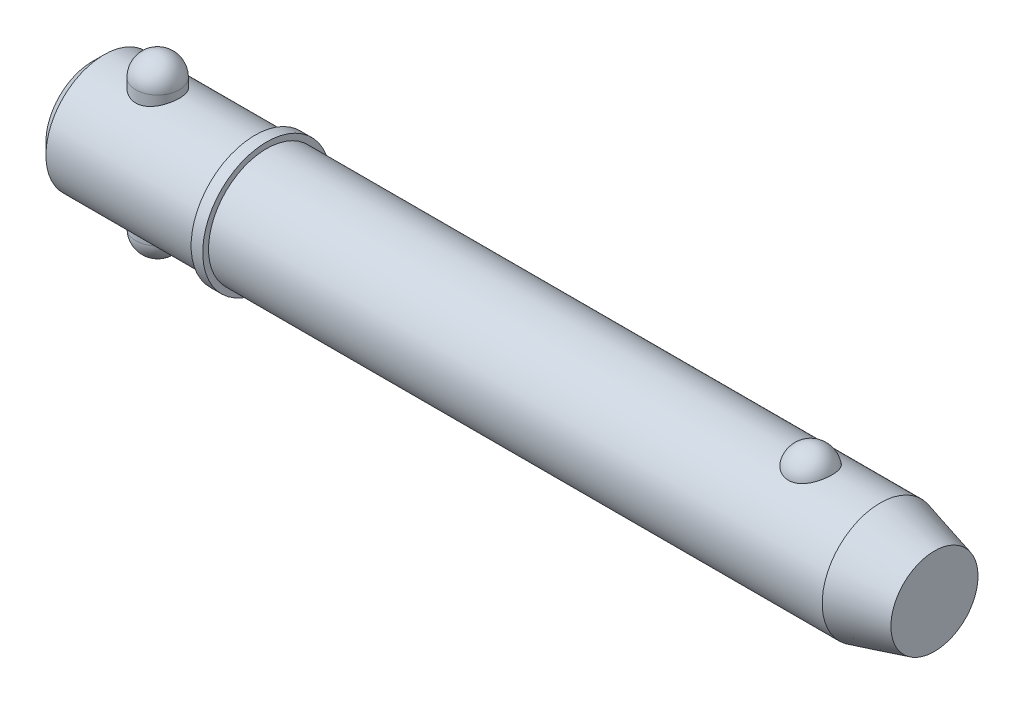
ISO-10303-21;
HEADER;
FILE_DESCRIPTION(('STEP AP214'),'2;1');
FILE_NAME('part.step','',(''),(''),'','','');
FILE_SCHEMA(('AUTOMOTIVE_DESIGN { 1 0 10303 214 1 1 1 1 }'));
ENDSEC;
DATA;
#1=APPLICATION_CONTEXT('core data for automotive mechanical design processes');
#2=APPLICATION_PROTOCOL_DEFINITION('international standard','automotive_design',2000,#1);
#3=PRODUCT_CONTEXT('',#1,'mechanical');
#4=PRODUCT('Part','Part','',(#3));
#5=PRODUCT_RELATED_PRODUCT_CATEGORY('part','',(#4));
#6=PRODUCT_DEFINITION_FORMATION('','',#4);
#7=PRODUCT_DEFINITION_CONTEXT('part definition',#1,'design');
#8=PRODUCT_DEFINITION('design','',#6,#7);
#9=PRODUCT_DEFINITION_SHAPE('','',#8);
#10=(LENGTH_UNIT() NAMED_UNIT(*) SI_UNIT(.MILLI.,.METRE.));
#11=(NAMED_UNIT(*) PLANE_ANGLE_UNIT() SI_UNIT($,.RADIAN.));
#12=(NAMED_UNIT(*) SI_UNIT($,.STERADIAN.) SOLID_ANGLE_UNIT());
#13=UNCERTAINTY_MEASURE_WITH_UNIT(LENGTH_MEASURE(1.E-05),#10,'distance_accuracy_value','');
#14=(GEOMETRIC_REPRESENTATION_CONTEXT(3) GLOBAL_UNCERTAINTY_ASSIGNED_CONTEXT((#13)) GLOBAL_UNIT_ASSIGNED_CONTEXT((#10,
#11,#12)) REPRESENTATION_CONTEXT('',''));
#15=CARTESIAN_POINT('',(0.,0.,0.));
#16=DIRECTION('',(0.,0.,1.));
#17=DIRECTION('',(1.,0.,0.));
#18=AXIS2_PLACEMENT_3D('',#15,#16,#17);
#19=CARTESIAN_POINT('',(14.28,19.05,0.));
#20=DIRECTION('',(0.,-1.,0.));
#21=DIRECTION('',(0.,0.,-1.));
#22=AXIS2_PLACEMENT_3D('',#19,#20,#21);
#23=CYLINDRICAL_SURFACE('',#22,4.76);
#24=CARTESIAN_POINT('',(14.28,-14.29,0.));
#25=DIRECTION('',(0.,-1.,0.));
#26=DIRECTION('',(0.,0.,-1.));
#27=AXIS2_PLACEMENT_3D('',#24,#25,#26);
#28=CIRCLE('',#27,4.76);
#29=CARTESIAN_POINT('',(14.28,-14.29,-4.76));
#30=VERTEX_POINT('',#29);
#31=EDGE_CURVE('P0_E10',#30,#30,#28,.F.);
#32=CARTESIAN_POINT('',(14.28,14.29,0.));
#33=DIRECTION('',(0.,-1.,0.));
#34=DIRECTION('',(0.,0.,-1.));
#35=AXIS2_PLACEMENT_3D('',#32,#33,#34);
#36=CIRCLE('',#35,4.76);
#37=CARTESIAN_POINT('',(14.28,14.29,-4.76));
#38=VERTEX_POINT('',#37);
#39=EDGE_CURVE('P0_E21',#38,#38,#36,.T.);
#40=CARTESIAN_POINT('',(14.28,-14.29,-4.76));
#41=CARTESIAN_POINT('',(14.28,-13.9922916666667,-4.76));
#42=CARTESIAN_POINT('',(14.28,-13.6945833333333,-4.76));
#43=CARTESIAN_POINT('',(14.28,-13.0991666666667,-4.76));
#44=CARTESIAN_POINT('',(14.28,-12.8014583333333,-4.76));
#45=CARTESIAN_POINT('',(14.28,-12.2060416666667,-4.76));
#46=CARTESIAN_POINT('',(14.28,-11.9083333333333,-4.76));
#47=CARTESIAN_POINT('',(14.28,-11.3129166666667,-4.76));
#48=CARTESIAN_POINT('',(14.28,-11.0152083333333,-4.76));
#49=CARTESIAN_POINT('',(14.28,-10.4197916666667,-4.76));
#50=CARTESIAN_POINT('',(14.28,-10.1220833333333,-4.76));
#51=CARTESIAN_POINT('',(14.28,-9.52666666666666,-4.76));
#52=CARTESIAN_POINT('',(14.28,-9.22895833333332,-4.76));
#53=CARTESIAN_POINT('',(14.28,-8.63354166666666,-4.76));
#54=CARTESIAN_POINT('',(14.28,-8.33583333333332,-4.76));
#55=CARTESIAN_POINT('',(14.28,-7.74041666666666,-4.76));
#56=CARTESIAN_POINT('',(14.28,-7.44270833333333,-4.76));
#57=CARTESIAN_POINT('',(14.28,-6.84729166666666,-4.76));
#58=CARTESIAN_POINT('',(14.28,-6.54958333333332,-4.76));
#59=CARTESIAN_POINT('',(14.28,-5.95416666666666,-4.76));
#60=CARTESIAN_POINT('',(14.28,-5.65645833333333,-4.76));
#61=CARTESIAN_POINT('',(14.28,-5.06104166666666,-4.76));
#62=CARTESIAN_POINT('',(14.28,-4.76333333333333,-4.76));
#63=CARTESIAN_POINT('',(14.28,-4.16791666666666,-4.76));
#64=CARTESIAN_POINT('',(14.28,-3.87020833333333,-4.76));
#65=CARTESIAN_POINT('',(14.28,-3.27479166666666,-4.76));
#66=CARTESIAN_POINT('',(14.28,-2.97708333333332,-4.76));
#67=CARTESIAN_POINT('',(14.28,-2.38166666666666,-4.76));
#68=CARTESIAN_POINT('',(14.28,-2.08395833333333,-4.76));
#69=CARTESIAN_POINT('',(14.28,-1.48854166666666,-4.76));
#70=CARTESIAN_POINT('',(14.28,-1.19083333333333,-4.76));
#71=CARTESIAN_POINT('',(14.28,-0.595416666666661,-4.76));
#72=CARTESIAN_POINT('',(14.28,-0.297708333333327,-4.76));
#73=CARTESIAN_POINT('',(14.28,0.297708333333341,-4.76));
#74=CARTESIAN_POINT('',(14.28,0.595416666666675,-4.76));
#75=CARTESIAN_POINT('',(14.28,1.19083333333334,-4.76));
#76=CARTESIAN_POINT('',(14.28,1.48854166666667,-4.76));
#77=CARTESIAN_POINT('',(14.28,2.08395833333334,-4.76));
#78=CARTESIAN_POINT('',(14.28,2.38166666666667,-4.76));
#79=CARTESIAN_POINT('',(14.28,2.97708333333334,-4.76));
#80=CARTESIAN_POINT('',(14.28,3.27479166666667,-4.76));
#81=CARTESIAN_POINT('',(14.28,3.87020833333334,-4.76));
#82=CARTESIAN_POINT('',(14.28,4.16791666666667,-4.76));
#83=CARTESIAN_POINT('',(14.28,4.76333333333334,-4.76));
#84=CARTESIAN_POINT('',(14.28,5.06104166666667,-4.76));
#85=CARTESIAN_POINT('',(14.28,5.65645833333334,-4.76));
#86=CARTESIAN_POINT('',(14.28,5.95416666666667,-4.76));
#87=CARTESIAN_POINT('',(14.28,6.54958333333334,-4.76));
#88=CARTESIAN_POINT('',(14.28,6.84729166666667,-4.76));
#89=CARTESIAN_POINT('',(14.28,7.44270833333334,-4.76));
#90=CARTESIAN_POINT('',(14.28,7.74041666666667,-4.76));
#91=CARTESIAN_POINT('',(14.28,8.33583333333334,-4.76));
#92=CARTESIAN_POINT('',(14.28,8.63354166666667,-4.76));
#93=CARTESIAN_POINT('',(14.28,9.22895833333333,-4.76));
#94=CARTESIAN_POINT('',(14.28,9.52666666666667,-4.76));
#95=CARTESIAN_POINT('',(14.28,10.1220833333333,-4.76));
#96=CARTESIAN_POINT('',(14.28,10.4197916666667,-4.76));
#97=CARTESIAN_POINT('',(14.28,11.0152083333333,-4.76));
#98=CARTESIAN_POINT('',(14.28,11.3129166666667,-4.76));
#99=CARTESIAN_POINT('',(14.28,11.9083333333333,-4.76));
#100=CARTESIAN_POINT('',(14.28,12.2060416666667,-4.76));
#101=CARTESIAN_POINT('',(14.28,12.8014583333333,-4.76));
#102=CARTESIAN_POINT('',(14.28,13.0991666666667,-4.76));
#103=CARTESIAN_POINT('',(14.28,13.6945833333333,-4.76));
#104=CARTESIAN_POINT('',(14.28,13.9922916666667,-4.76));
#105=CARTESIAN_POINT('',(14.28,14.29,-4.76));
#106=B_SPLINE_CURVE_WITH_KNOTS('',3,(#40,#41,#42,#43,#44,#45,#46,#47,#48,#49,#50,#51,#52,#53,
#54,#55,#56,#57,#58,#59,#60,#61,#62,#63,#64,#65,#66,#67,#68,#69,#70,#71,#72,#73,#74,#75,#76,#77,
#78,#79,#80,#81,#82,#83,#84,#85,#86,#87,#88,#89,#90,#91,#92,#93,#94,#95,#96,#97,#98,#99,#100,
#101,#102,#103,#104,#105),.UNSPECIFIED.,.F.,.F.,(4,2,2,2,2,2,2,2,2,2,2,2,2,2,2,2,2,2,2,2,2,2,2,
2,2,2,2,2,2,2,2,2,4),(0.,0.893125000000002,1.78625,2.67937499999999,3.5725,4.465625,5.35875,
6.25187499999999,7.145,8.038125,8.93125,9.82437499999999,10.7175,11.610625,12.50375,13.396875,
14.29,15.183125,16.07625,16.969375,17.8625,18.755625,19.64875,20.541875,21.435,22.328125,
23.22125,24.114375,25.0075,25.900625,26.79375,27.686875,28.58),.UNSPECIFIED.);
#107=EDGE_CURVE('P0_BSEAM14',#30,#38,#106,.T.);
#108=ORIENTED_EDGE('',*,*,#31,.T.);
#109=ORIENTED_EDGE('',*,*,#39,.T.);
#110=ORIENTED_EDGE('',*,*,#107,.T.);
#111=ORIENTED_EDGE('',*,*,#107,.F.);
#112=EDGE_LOOP('',(#108,#110,#109,#111));
#113=FACE_BOUND('',#112,.T.);
#114=ADVANCED_FACE('P0_F14',(#113),#23,.T.);
#115=CARTESIAN_POINT('',(14.28,-14.29,0.));
#116=DIRECTION('',(0.,0.,1.));
#117=DIRECTION('',(1.,0.,0.));
#118=AXIS2_PLACEMENT_3D('',#115,#116,#117);
#119=SPHERICAL_SURFACE('',#118,4.76);
#120=CARTESIAN_POINT('',(14.28,-14.29,0.));
#121=DIRECTION('',(0.,-1.,0.));
#122=DIRECTION('',(0.,0.,-1.));
#123=AXIS2_PLACEMENT_3D('',#120,#121,#122);
#124=SPHERICAL_SURFACE('',#123,4.76);
#125=ORIENTED_EDGE('',*,*,#31,.F.);
#126=EDGE_LOOP('',(#125));
#127=FACE_BOUND('',#126,.T.);
#128=ADVANCED_FACE('P0_F29',(#127),#124,.T.);
#129=CARTESIAN_POINT('',(14.28,14.29,0.));
#130=DIRECTION('',(0.,0.,1.));
#131=DIRECTION('',(1.,0.,0.));
#132=AXIS2_PLACEMENT_3D('',#129,#130,#131);
#133=SPHERICAL_SURFACE('',#132,4.76);
#134=CARTESIAN_POINT('',(14.28,14.29,0.));
#135=DIRECTION('',(0.,-1.,0.));
#136=DIRECTION('',(0.,0.,-1.));
#137=AXIS2_PLACEMENT_3D('',#134,#135,#136);
#138=SPHERICAL_SURFACE('',#137,4.76);
#139=ORIENTED_EDGE('',*,*,#39,.F.);
#140=EDGE_LOOP('',(#139));
#141=FACE_BOUND('',#140,.T.);
#142=ADVANCED_FACE('P0_F16',(#141),#138,.T.);
#143=CLOSED_SHELL('',(#114,#128,#142));
#144=MANIFOLD_SOLID_BREP('P0_B1',#143);
#145=CARTESIAN_POINT('',(0.,0.,0.));
#146=DIRECTION('',(1.,0.,0.));
#147=DIRECTION('',(0.,0.,-1.));
#148=AXIS2_PLACEMENT_3D('',#145,#146,#147);
#149=CYLINDRICAL_SURFACE('',#148,12.7);
#150=CARTESIAN_POINT('',(172.300738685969,0.,0.));
#151=DIRECTION('',(1.,0.,0.));
#152=DIRECTION('',(0.,0.,-1.));
#153=AXIS2_PLACEMENT_3D('',#150,#151,#152);
#154=CIRCLE('',#153,12.7);
#155=CARTESIAN_POINT('',(172.300738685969,0.,-12.7));
#156=VERTEX_POINT('',#155);
#157=EDGE_CURVE('P1_E81',#156,#156,#154,.T.);
#158=ORIENTED_EDGE('',*,*,#157,.F.);
#159=EDGE_LOOP('',(#158));
#160=FACE_BOUND('',#159,.T.);
#161=CARTESIAN_POINT('',(38.1,0.,0.));
#162=DIRECTION('',(1.,0.,0.));
#163=DIRECTION('',(0.,0.,-1.));
#164=AXIS2_PLACEMENT_3D('',#161,#162,#163);
#165=CIRCLE('',#164,12.7);
#166=CARTESIAN_POINT('',(38.1,0.,-12.7));
#167=VERTEX_POINT('',#166);
#168=EDGE_CURVE('P1_E85',#167,#167,#165,.T.);
#169=ORIENTED_EDGE('',*,*,#168,.T.);
#170=EDGE_LOOP('',(#169));
#171=FACE_BOUND('',#170,.T.);
#172=CARTESIAN_POINT('',(157.060042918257,11.7500437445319,4.81938502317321));
#173=CARTESIAN_POINT('',(156.935088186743,11.7500430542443,4.81938571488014));
#174=CARTESIAN_POINT('',(156.810144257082,11.7520975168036,4.81438658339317));
#175=CARTESIAN_POINT('',(156.561142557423,11.760253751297,4.7944290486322));
#176=CARTESIAN_POINT('',(156.437085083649,11.7663568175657,4.77946746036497));
#177=CARTESIAN_POINT('',(156.190901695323,11.7824262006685,4.73971414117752));
#178=CARTESIAN_POINT('',(156.068774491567,11.7923898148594,4.71492928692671));
#179=CARTESIAN_POINT('',(155.827187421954,11.8158938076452,4.65571340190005));
#180=CARTESIAN_POINT('',(155.70772859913,11.8294355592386,4.62127866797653));
#181=CARTESIAN_POINT('',(155.472557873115,11.8596812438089,4.5430950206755));
#182=CARTESIAN_POINT('',(155.356839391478,11.8763792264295,4.49936361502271));
#183=CARTESIAN_POINT('',(155.129653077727,11.9124878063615,4.40287235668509));
#184=CARTESIAN_POINT('',(155.018186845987,11.9318994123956,4.35010914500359));
#185=CARTESIAN_POINT('',(154.691278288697,11.9934256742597,4.17881316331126));
#186=CARTESIAN_POINT('',(154.483127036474,12.038858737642,4.04720756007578));
#187=CARTESIAN_POINT('',(154.085850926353,12.1352173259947,3.74856446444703));
#188=CARTESIAN_POINT('',(153.897443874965,12.1862630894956,3.58061821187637));
#189=CARTESIAN_POINT('',(153.550521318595,12.2875163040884,3.21600758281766));
#190=CARTESIAN_POINT('',(153.392011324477,12.3377235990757,3.01933792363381));
#191=CARTESIAN_POINT('',(153.10168878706,12.434492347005,2.59291655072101));
#192=CARTESIAN_POINT('',(152.971376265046,12.4807925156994,2.36208286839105));
#193=CARTESIAN_POINT('',(152.749407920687,12.5623454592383,1.88070399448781));
#194=CARTESIAN_POINT('',(152.657755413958,12.5975972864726,1.63015711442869));
#195=CARTESIAN_POINT('',(152.514046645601,12.6538414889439,1.11298869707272));
#196=CARTESIAN_POINT('',(152.462499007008,12.6746503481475,0.846205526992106));
#197=CARTESIAN_POINT('',(152.401977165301,12.699153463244,0.307085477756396));
#198=CARTESIAN_POINT('',(152.393001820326,12.7028481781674,0.0347487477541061));
#199=CARTESIAN_POINT('',(152.417731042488,12.6927785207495,-0.506073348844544));
#200=CARTESIAN_POINT('',(152.451189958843,12.6791146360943,-0.774571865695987));
#201=CARTESIAN_POINT('',(152.559687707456,12.635882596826,-1.30170246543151));
#202=CARTESIAN_POINT('',(152.63472729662,12.606314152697,-1.5603343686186));
#203=CARTESIAN_POINT('',(152.82500006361,12.5342328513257,-2.06083899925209));
#204=CARTESIAN_POINT('',(152.940287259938,12.4917026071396,-2.30268867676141));
#205=CARTESIAN_POINT('',(153.208704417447,12.3981123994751,-2.76259600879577));
#206=CARTESIAN_POINT('',(153.361837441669,12.3470517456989,-2.98065173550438));
#207=CARTESIAN_POINT('',(153.703507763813,12.2416045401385,-3.38786328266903));
#208=CARTESIAN_POINT('',(153.892201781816,12.1872040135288,-3.57688418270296));
#209=CARTESIAN_POINT('',(154.300239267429,12.0814086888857,-3.91941073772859));
#210=CARTESIAN_POINT('',(154.519580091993,12.0300136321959,-4.07291945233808));
#211=CARTESIAN_POINT('',(154.978375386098,11.9373542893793,-4.3369128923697));
#212=CARTESIAN_POINT('',(155.217304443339,11.8958982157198,-4.4482412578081));
#213=CARTESIAN_POINT('',(155.71243761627,11.8268116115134,-4.62881985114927));
#214=CARTESIAN_POINT('',(155.968635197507,11.7991758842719,-4.69808589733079));
#215=CARTESIAN_POINT('',(156.477164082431,11.7622209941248,-4.7898318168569));
#216=CARTESIAN_POINT('',(156.729041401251,11.7520502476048,-4.81449025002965));
#217=CARTESIAN_POINT('',(157.233573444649,11.7485796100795,-4.82295735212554));
#218=CARTESIAN_POINT('',(157.486228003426,11.7552763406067,-4.80677420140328));
#219=CARTESIAN_POINT('',(157.976834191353,11.7842584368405,-4.73525430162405));
#220=CARTESIAN_POINT('',(158.214998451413,11.8060486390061,-4.68116061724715));
#221=CARTESIAN_POINT('',(158.678489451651,11.8622750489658,-4.53678133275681));
#222=CARTESIAN_POINT('',(158.903815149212,11.8967122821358,-4.44649279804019));
#223=CARTESIAN_POINT('',(159.340801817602,11.9754603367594,-4.22987613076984));
#224=CARTESIAN_POINT('',(159.552057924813,12.0199699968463,-4.1028053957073));
#225=CARTESIAN_POINT('',(159.950601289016,12.1138028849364,-3.81685409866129));
#226=CARTESIAN_POINT('',(160.137883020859,12.163127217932,-3.65796622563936));
#227=CARTESIAN_POINT('',(160.493350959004,12.2642343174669,-3.30364864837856));
#228=CARTESIAN_POINT('',(160.660111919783,12.3160165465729,-3.10678783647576));
#229=CARTESIAN_POINT('',(160.959579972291,12.4142566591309,-2.68748409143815));
#230=CARTESIAN_POINT('',(161.092280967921,12.4607135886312,-2.46503658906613));
#231=CARTESIAN_POINT('',(161.324691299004,12.5450236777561,-1.99289519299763));
#232=CARTESIAN_POINT('',(161.423215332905,12.5825557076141,-1.74255918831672));
#233=CARTESIAN_POINT('',(161.579227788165,12.6431720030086,-1.22773734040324));
#234=CARTESIAN_POINT('',(161.636715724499,12.6662560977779,-0.963251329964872));
#235=CARTESIAN_POINT('',(161.709544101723,12.6956486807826,-0.42735507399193));
#236=CARTESIAN_POINT('',(161.724837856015,12.7019385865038,-0.155937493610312));
#237=CARTESIAN_POINT('',(161.712779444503,12.6970201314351,0.385928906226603));
#238=CARTESIAN_POINT('',(161.68542805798,12.6858120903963,0.656377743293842));
#239=CARTESIAN_POINT('',(161.613060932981,12.6568455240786,1.0545401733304));
#240=CARTESIAN_POINT('',(161.583796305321,12.6451962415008,1.18577850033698));
#241=CARTESIAN_POINT('',(161.515022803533,12.6181819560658,1.44513808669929));
#242=CARTESIAN_POINT('',(161.475517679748,12.6028183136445,1.57326046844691));
#243=CARTESIAN_POINT('',(161.386439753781,12.5687547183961,1.82554978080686));
#244=CARTESIAN_POINT('',(161.336862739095,12.5500533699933,1.9497150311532));
#245=CARTESIAN_POINT('',(161.22792115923,12.5098093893,2.19314370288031));
#246=CARTESIAN_POINT('',(161.168560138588,12.4882677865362,2.31240887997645));
#247=CARTESIAN_POINT('',(161.03997128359,12.4427679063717,2.54593031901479));
#248=CARTESIAN_POINT('',(160.970688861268,12.4187964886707,2.66015396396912));
#249=CARTESIAN_POINT('',(160.822903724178,12.3691892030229,2.88202659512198));
#250=CARTESIAN_POINT('',(160.744404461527,12.3435539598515,2.98967802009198));
#251=CARTESIAN_POINT('',(160.578550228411,12.2912955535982,3.19774385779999));
#252=CARTESIAN_POINT('',(160.491191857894,12.2646720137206,3.298155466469));
#253=CARTESIAN_POINT('',(160.308161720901,12.2111945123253,3.49095035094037));
#254=CARTESIAN_POINT('',(160.212493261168,12.1843406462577,3.58333679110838));
#255=CARTESIAN_POINT('',(160.013627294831,12.1312249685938,3.75922876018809));
#256=CARTESIAN_POINT('',(159.910450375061,12.104961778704,3.84275713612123));
#257=CARTESIAN_POINT('',(159.69701336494,12.0537284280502,4.00056406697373));
#258=CARTESIAN_POINT('',(159.586756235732,12.028757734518,4.07484645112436));
#259=CARTESIAN_POINT('',(159.359755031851,11.9808306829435,4.21367959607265));
#260=CARTESIAN_POINT('',(159.243006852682,11.9578756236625,4.27822410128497));
#261=CARTESIAN_POINT('',(159.00394258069,11.9147184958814,4.39698483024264));
#262=CARTESIAN_POINT('',(158.881628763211,11.894515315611,4.45120522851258));
#263=CARTESIAN_POINT('',(158.622952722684,11.8561129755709,4.55255353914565));
#264=CARTESIAN_POINT('',(158.486223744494,11.8381764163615,4.59884858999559));
#265=CARTESIAN_POINT('',(158.208608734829,11.8069093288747,4.67853897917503));
#266=CARTESIAN_POINT('',(158.067724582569,11.7935767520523,4.71194005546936));
#267=CARTESIAN_POINT('',(157.78309446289,11.7720277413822,4.76552188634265));
#268=CARTESIAN_POINT('',(157.639348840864,11.7638106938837,4.78570422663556));
#269=CARTESIAN_POINT('',(157.350411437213,11.7528195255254,4.81263433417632));
#270=CARTESIAN_POINT('',(157.205219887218,11.7500445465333,4.81938421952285));
#271=CARTESIAN_POINT('',(157.060042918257,11.7500437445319,4.81938502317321));
#272=B_SPLINE_CURVE_WITH_KNOTS('',3,(#172,#173,#174,#175,#176,#177,#178,#179,#180,#181,#182,
#183,#184,#185,#186,#187,#188,#189,#190,#191,#192,#193,#194,#195,#196,#197,#198,#199,#200,#201,
#202,#203,#204,#205,#206,#207,#208,#209,#210,#211,#212,#213,#214,#215,#216,#217,#218,#219,#220,
#221,#222,#223,#224,#225,#226,#227,#228,#229,#230,#231,#232,#233,#234,#235,#236,#237,#238,#239,
#240,#241,#242,#243,#244,#245,#246,#247,#248,#249,#250,#251,#252,#253,#254,#255,#256,#257,#258,
#259,#260,#261,#262,#263,#264,#265,#266,#267,#268,#269,#270,#271),.UNSPECIFIED.,.T.,.F.,(4,2,2,
2,2,2,2,2,2,2,2,2,2,2,2,2,2,2,2,2,2,2,2,2,2,2,2,2,2,2,2,2,2,2,2,2,2,2,2,2,2,2,2,2,2,2,2,2,2,4),
(0.,0.374729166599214,0.749578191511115,1.12416526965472,1.49889629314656,1.87292776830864,
2.24709865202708,2.99481328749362,3.76399449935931,4.53331735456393,5.33683915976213,
6.14042986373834,6.95405296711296,7.76765424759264,8.57656703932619,9.38549455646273,
10.1955119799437,11.0055949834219,11.8193353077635,12.633005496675,13.4294141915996,
14.2255231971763,14.9815786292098,15.7374826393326,16.4696948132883,17.2019663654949,
17.9501979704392,18.6986017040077,19.4844704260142,20.2704797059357,21.0815215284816,
21.8925729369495,22.7045213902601,23.5164550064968,23.9209608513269,24.3253187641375,
24.7298461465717,25.1342272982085,25.5409255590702,25.9474719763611,26.3541750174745,
26.7607169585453,27.1661834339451,27.5714814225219,27.9770386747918,28.3824315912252,
28.8181206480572,29.2536155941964,29.6890582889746,30.1244323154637),.UNSPECIFIED.);
#273=CARTESIAN_POINT('',(157.060042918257,11.7500437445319,4.81938502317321));
#274=VERTEX_POINT('',#273);
#275=EDGE_CURVE('P1_E35',#274,#274,#272,.T.);
#276=ORIENTED_EDGE('',*,*,#275,.T.);
#277=EDGE_LOOP('',(#276));
#278=FACE_BOUND('',#277,.T.);
#279=ADVANCED_FACE('P1_F13',(#160,#171,#278),#149,.T.);
#280=CARTESIAN_POINT('',(0.,0.,0.));
#281=DIRECTION('',(-1.,0.,0.));
#282=DIRECTION('',(0.,0.,1.));
#283=AXIS2_PLACEMENT_3D('',#280,#281,#282);
#284=PLANE('',#283);
#285=CARTESIAN_POINT('',(0.,0.,0.));
#286=DIRECTION('',(1.,0.,0.));
#287=DIRECTION('',(0.,0.,-1.));
#288=AXIS2_PLACEMENT_3D('',#285,#286,#287);
#289=CIRCLE('',#288,10.16);
#290=CARTESIAN_POINT('',(0.,0.,-10.16));
#291=VERTEX_POINT('',#290);
#292=EDGE_CURVE('P1_E9',#291,#291,#289,.T.);
#293=ORIENTED_EDGE('',*,*,#292,.F.);
#294=EDGE_LOOP('',(#293));
#295=FACE_BOUND('',#294,.T.);
#296=ADVANCED_FACE('P1_F15',(#295),#284,.T.);
#297=CARTESIAN_POINT('',(2.53999999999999,0.,0.));
#298=DIRECTION('',(1.,0.,0.));
#299=DIRECTION('',(0.,0.,-1.));
#300=AXIS2_PLACEMENT_3D('',#297,#298,#299);
#301=CONICAL_SURFACE('',#300,12.7,0.78539816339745);
#302=ORIENTED_EDGE('',*,*,#292,.T.);
#303=EDGE_LOOP('',(#302));
#304=FACE_BOUND('',#303,.T.);
#305=CARTESIAN_POINT('',(2.53999999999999,0.,0.));
#306=DIRECTION('',(1.,0.,0.));
#307=DIRECTION('',(0.,0.,-1.));
#308=AXIS2_PLACEMENT_3D('',#305,#306,#307);
#309=CIRCLE('',#308,12.7);
#310=CARTESIAN_POINT('',(2.53999999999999,0.,-12.7));
#311=VERTEX_POINT('',#310);
#312=EDGE_CURVE('P1_E26',#311,#311,#309,.T.);
#313=ORIENTED_EDGE('',*,*,#312,.F.);
#314=EDGE_LOOP('',(#313));
#315=FACE_BOUND('',#314,.T.);
#316=ADVANCED_FACE('P1_F77',(#304,#315),#301,.T.);
#317=CARTESIAN_POINT('',(0.,0.,0.));
#318=DIRECTION('',(1.,0.,0.));
#319=DIRECTION('',(0.,0.,-1.));
#320=AXIS2_PLACEMENT_3D('',#317,#318,#319);
#321=CYLINDRICAL_SURFACE('',#320,12.7);
#322=CARTESIAN_POINT('',(14.28,-11.7742260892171,4.76));
#323=CARTESIAN_POINT('',(14.1514948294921,-11.7742255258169,4.76000061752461));
#324=CARTESIAN_POINT('',(14.0229980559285,-11.7763355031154,4.75479194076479));
#325=CARTESIAN_POINT('',(13.7669369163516,-11.7847043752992,4.73401198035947));
#326=CARTESIAN_POINT('',(13.6393728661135,-11.7909646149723,4.71843733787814));
#327=CARTESIAN_POINT('',(13.386226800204,-11.8074248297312,4.67709434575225));
#328=CARTESIAN_POINT('',(13.2606439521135,-11.8176231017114,4.65133040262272));
#329=CARTESIAN_POINT('',(13.0122434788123,-11.8416347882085,4.58985545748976));
#330=CARTESIAN_POINT('',(12.8894269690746,-11.8554496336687,4.55414051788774));
#331=CARTESIAN_POINT('',(12.6477622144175,-11.8862222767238,4.47320764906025));
#332=CARTESIAN_POINT('',(12.5289037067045,-11.9031710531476,4.4280169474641));
#333=CARTESIAN_POINT('',(12.2955059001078,-11.939736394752,4.32845291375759));
#334=CARTESIAN_POINT('',(12.1809682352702,-11.9593539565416,4.2740761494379));
#335=CARTESIAN_POINT('',(11.8448901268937,-12.0213893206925,4.09777237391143));
#336=CARTESIAN_POINT('',(11.6307077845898,-12.0670135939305,3.9626122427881));
#337=CARTESIAN_POINT('',(11.2179129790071,-12.1641514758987,3.65386230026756));
#338=CARTESIAN_POINT('',(11.0204399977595,-12.2158379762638,3.47881300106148));
#339=CARTESIAN_POINT('',(10.6568212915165,-12.3178468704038,3.09829182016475));
#340=CARTESIAN_POINT('',(10.4906822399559,-12.3681689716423,2.89281347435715));
#341=CARTESIAN_POINT('',(10.1890299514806,-12.4638367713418,2.44867909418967));
#342=CARTESIAN_POINT('',(10.054749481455,-12.5089552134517,2.20913281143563));
#343=CARTESIAN_POINT('',(9.82886079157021,-12.5870472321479,1.70885919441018));
#344=CARTESIAN_POINT('',(9.73723778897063,-12.620025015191,1.44813923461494));
#345=CARTESIAN_POINT('',(9.60324488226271,-12.6688874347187,0.9248423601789));
#346=CARTESIAN_POINT('',(9.55892269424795,-12.6854474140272,0.662829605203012));
#347=CARTESIAN_POINT('',(9.5145335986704,-12.7020320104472,0.134596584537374));
#348=CARTESIAN_POINT('',(9.5144523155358,-12.7020619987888,-0.131622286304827));
#349=CARTESIAN_POINT('',(9.55741019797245,-12.6860129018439,-0.646717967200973));
#350=CARTESIAN_POINT('',(9.59831845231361,-12.6707298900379,-0.895801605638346));
#351=CARTESIAN_POINT('',(9.71850987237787,-12.6268158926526,-1.38327219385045));
#352=CARTESIAN_POINT('',(9.79779575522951,-12.5981839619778,-1.62165838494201));
#353=CARTESIAN_POINT('',(9.99348296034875,-12.5298894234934,-2.08508424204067));
#354=CARTESIAN_POINT('',(10.110407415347,-12.4900724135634,-2.30987931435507));
#355=CARTESIAN_POINT('',(10.3775896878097,-12.4034373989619,-2.7372158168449));
#356=CARTESIAN_POINT('',(10.5278582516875,-12.3566171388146,-2.93975004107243));
#357=CARTESIAN_POINT('',(10.8677318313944,-12.257571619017,-3.32936830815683));
#358=CARTESIAN_POINT('',(11.0591227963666,-12.2051903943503,-3.51485714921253));
#359=CARTESIAN_POINT('',(11.4706087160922,-12.1031155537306,-3.85170663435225));
#360=CARTESIAN_POINT('',(11.6907108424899,-12.0534226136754,-4.00305872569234));
#361=CARTESIAN_POINT('',(12.1596597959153,-11.9613684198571,-4.27038218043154));
#362=CARTESIAN_POINT('',(12.4090353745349,-11.9191939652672,-4.38549550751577));
#363=CARTESIAN_POINT('',(12.9256290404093,-11.8491124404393,-4.57149117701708));
#364=CARTESIAN_POINT('',(13.1928371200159,-11.8211974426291,-4.64239810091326));
#365=CARTESIAN_POINT('',(13.7217488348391,-11.7846654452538,-4.73434137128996));
#366=CARTESIAN_POINT('',(13.9829438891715,-11.7750694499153,-4.75791141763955));
#367=CARTESIAN_POINT('',(14.5056760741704,-11.7734909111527,-4.76182097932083));
#368=CARTESIAN_POINT('',(14.7672131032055,-11.7815039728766,-4.74217128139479));
#369=CARTESIAN_POINT('',(15.2702140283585,-11.8132466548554,-4.66249544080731));
#370=CARTESIAN_POINT('',(15.5120417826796,-11.8362133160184,-4.60442726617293));
#371=CARTESIAN_POINT('',(15.9824097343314,-11.8943704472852,-4.45202868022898));
#372=CARTESIAN_POINT('',(16.2109472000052,-11.9295634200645,-4.35769084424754));
#373=CARTESIAN_POINT('',(16.6577741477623,-12.0098310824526,-4.13144368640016));
#374=CARTESIAN_POINT('',(16.8753590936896,-12.055226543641,-3.99825937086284));
#375=CARTESIAN_POINT('',(17.2859732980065,-12.150238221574,-3.69949845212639));
#376=CARTESIAN_POINT('',(17.4789935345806,-12.19985597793,-3.5339100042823));
#377=CARTESIAN_POINT('',(17.8477707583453,-12.3015434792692,-3.1624728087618));
#378=CARTESIAN_POINT('',(18.0216609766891,-12.3535695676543,-2.95473880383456));
#379=CARTESIAN_POINT('',(18.254545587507,-12.426745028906,-2.62277433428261));
#380=CARTESIAN_POINT('',(18.3275489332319,-12.4503382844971,-2.50865480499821));
#381=CARTESIAN_POINT('',(18.463723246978,-12.4952713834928,-2.27428971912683));
#382=CARTESIAN_POINT('',(18.5268984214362,-12.5166121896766,-2.15404681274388));
#383=CARTESIAN_POINT('',(18.6427140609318,-12.5563817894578,-1.90858448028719));
#384=CARTESIAN_POINT('',(18.6953855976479,-12.5748191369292,-1.78338108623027));
#385=CARTESIAN_POINT('',(18.7899337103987,-12.6083284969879,-1.52857834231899));
#386=CARTESIAN_POINT('',(18.8318147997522,-12.6234019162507,-1.39898085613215));
#387=CARTESIAN_POINT('',(18.9043819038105,-12.6497495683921,-1.13633254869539));
#388=CARTESIAN_POINT('',(18.9350698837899,-12.6610244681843,-1.00328233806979));
#389=CARTESIAN_POINT('',(18.9849303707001,-12.6794412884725,-0.734761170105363));
#390=CARTESIAN_POINT('',(19.0041035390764,-12.6865834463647,-0.59929035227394));
#391=CARTESIAN_POINT('',(19.0299427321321,-12.6962286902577,-0.335006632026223));
#392=CARTESIAN_POINT('',(19.0372742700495,-12.698978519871,-0.206267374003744));
#393=CARTESIAN_POINT('',(19.0414668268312,-12.7005496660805,0.0514515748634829));
#394=CARTESIAN_POINT('',(19.038324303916,-12.69936965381,0.180431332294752));
#395=CARTESIAN_POINT('',(19.0215965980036,-12.6931114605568,0.437551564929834));
#396=CARTESIAN_POINT('',(19.0080165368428,-12.6880351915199,0.565692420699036));
#397=CARTESIAN_POINT('',(18.9705519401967,-12.6741222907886,0.820297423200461));
#398=CARTESIAN_POINT('',(18.9466635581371,-12.665284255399,0.946760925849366));
#399=CARTESIAN_POINT('',(18.8895279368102,-12.6443449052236,1.19395899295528));
#400=CARTESIAN_POINT('',(18.8565273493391,-12.6323299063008,1.3147578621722));
#401=CARTESIAN_POINT('',(18.781239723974,-12.6052503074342,1.55308888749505));
#402=CARTESIAN_POINT('',(18.738949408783,-12.5901846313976,1.67061987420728));
#403=CARTESIAN_POINT('',(18.5986461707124,-12.5409473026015,2.01714406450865));
#404=CARTESIAN_POINT('',(18.4871532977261,-12.502717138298,2.24027279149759));
#405=CARTESIAN_POINT('',(18.2262440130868,-12.4173042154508,2.6742599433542));
#406=CARTESIAN_POINT('',(18.0754310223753,-12.3698127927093,2.88420891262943));
#407=CARTESIAN_POINT('',(17.7421836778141,-12.271667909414,3.27675114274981));
#408=CARTESIAN_POINT('',(17.5597380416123,-12.2210133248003,3.45933459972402));
#409=CARTESIAN_POINT('',(17.2605468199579,-12.1452079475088,3.7138066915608));
#410=CARTESIAN_POINT('',(17.1535518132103,-12.119328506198,3.79719993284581));
#411=CARTESIAN_POINT('',(16.9326449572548,-12.0688597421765,3.95467398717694));
#412=CARTESIAN_POINT('',(16.8187356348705,-12.0442699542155,4.02875817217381));
#413=CARTESIAN_POINT('',(16.5846234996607,-11.9971053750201,4.16711104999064));
#414=CARTESIAN_POINT('',(16.4644172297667,-11.9745317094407,4.23137427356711));
#415=CARTESIAN_POINT('',(16.2185866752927,-11.9321360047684,4.34949041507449));
#416=CARTESIAN_POINT('',(16.09296473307,-11.9123127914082,4.40334777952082));
#417=CARTESIAN_POINT('',(15.8314769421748,-11.875268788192,4.50232278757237));
#418=CARTESIAN_POINT('',(15.6954035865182,-11.8582009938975,4.54695127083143));
#419=CARTESIAN_POINT('',(15.4194002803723,-11.8284328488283,4.62383807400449));
#420=CARTESIAN_POINT('',(15.2794720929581,-11.815730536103,4.6561019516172));
#421=CARTESIAN_POINT('',(14.9969657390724,-11.7951940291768,4.70788444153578));
#422=CARTESIAN_POINT('',(14.8543884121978,-11.7873583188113,4.72740702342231));
#423=CARTESIAN_POINT('',(14.5678704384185,-11.7768749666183,4.75346370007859));
#424=CARTESIAN_POINT('',(14.4239299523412,-11.7742267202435,4.75999930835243));
#425=CARTESIAN_POINT('',(14.28,-11.7742260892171,4.76));
#426=B_SPLINE_CURVE_WITH_KNOTS('',3,(#322,#323,#324,#325,#326,#327,#328,#329,#330,#331,#332,
#333,#334,#335,#336,#337,#338,#339,#340,#341,#342,#343,#344,#345,#346,#347,#348,#349,#350,#351,
#352,#353,#354,#355,#356,#357,#358,#359,#360,#361,#362,#363,#364,#365,#366,#367,#368,#369,#370,
#371,#372,#373,#374,#375,#376,#377,#378,#379,#380,#381,#382,#383,#384,#385,#386,#387,#388,#389,
#390,#391,#392,#393,#394,#395,#396,#397,#398,#399,#400,#401,#402,#403,#404,#405,#406,#407,#408,
#409,#410,#411,#412,#413,#414,#415,#416,#417,#418,#419,#420,#421,#422,#423,#424,#425),
.UNSPECIFIED.,.T.,.F.,(4,2,2,2,2,2,2,2,2,2,2,2,2,2,2,2,2,2,2,2,2,2,2,2,2,2,2,2,2,2,2,2,2,2,2,2,
2,2,2,2,2,2,2,2,2,2,2,2,2,2,2,4),(0.,0.385378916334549,0.770882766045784,1.15622008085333,
1.54171009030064,1.92610725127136,2.31064835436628,3.07917291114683,3.88239385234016,
4.68578566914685,5.51648193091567,6.34689010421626,7.14151420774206,7.93588010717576,
8.69098665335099,9.44614666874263,10.2122918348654,10.9786842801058,11.789876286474,
12.6012713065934,13.4306405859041,14.2595482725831,15.0427613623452,15.8257790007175,
16.5716820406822,17.3177378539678,18.0917395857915,18.8660247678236,19.6893332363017,
20.1014571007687,20.5134040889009,20.9241137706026,21.3346513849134,21.7451168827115,
22.1555587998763,22.542011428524,22.928594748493,23.3149884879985,23.7015265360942,
24.0784835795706,24.4555738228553,25.2091300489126,25.994347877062,26.7798463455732,
27.1937428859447,27.6074890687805,28.0214648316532,28.4352633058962,28.8672794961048,
29.299101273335,29.7307884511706,30.1624253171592),.UNSPECIFIED.);
#427=CARTESIAN_POINT('',(14.28,-11.7742260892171,4.76));
#428=VERTEX_POINT('',#427);
#429=EDGE_CURVE('P1_E17',#428,#428,#426,.T.);
#430=ORIENTED_EDGE('',*,*,#429,.F.);
#431=EDGE_LOOP('',(#430));
#432=FACE_BOUND('',#431,.T.);
#433=CARTESIAN_POINT('',(14.28,11.7742260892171,4.76));
#434=CARTESIAN_POINT('',(14.4085051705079,11.7742255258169,4.76000061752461));
#435=CARTESIAN_POINT('',(14.5370019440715,11.7763355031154,4.75479194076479));
#436=CARTESIAN_POINT('',(14.7930630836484,11.7847043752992,4.73401198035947));
#437=CARTESIAN_POINT('',(14.9206271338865,11.7909646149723,4.71843733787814));
#438=CARTESIAN_POINT('',(15.173773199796,11.8074248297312,4.67709434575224));
#439=CARTESIAN_POINT('',(15.2993560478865,11.8176231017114,4.65133040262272));
#440=CARTESIAN_POINT('',(15.5477565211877,11.8416347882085,4.58985545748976));
#441=CARTESIAN_POINT('',(15.6705730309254,11.8554496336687,4.55414051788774));
#442=CARTESIAN_POINT('',(15.9122377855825,11.8862222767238,4.47320764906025));
#443=CARTESIAN_POINT('',(16.0310962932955,11.9031710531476,4.4280169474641));
#444=CARTESIAN_POINT('',(16.2644940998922,11.939736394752,4.32845291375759));
#445=CARTESIAN_POINT('',(16.3790317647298,11.9593539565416,4.2740761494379));
#446=CARTESIAN_POINT('',(16.7151098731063,12.0213893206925,4.09777237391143));
#447=CARTESIAN_POINT('',(16.9292922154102,12.0670135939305,3.96261224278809));
#448=CARTESIAN_POINT('',(17.3420870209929,12.1641514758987,3.65386230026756));
#449=CARTESIAN_POINT('',(17.5395600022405,12.2158379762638,3.47881300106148));
#450=CARTESIAN_POINT('',(17.9031787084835,12.3178468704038,3.09829182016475));
#451=CARTESIAN_POINT('',(18.0693177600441,12.3681689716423,2.89281347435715));
#452=CARTESIAN_POINT('',(18.3709700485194,12.4638367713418,2.44867909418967));
#453=CARTESIAN_POINT('',(18.505250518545,12.5089552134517,2.20913281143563));
#454=CARTESIAN_POINT('',(18.7311392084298,12.5870472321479,1.70885919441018));
#455=CARTESIAN_POINT('',(18.8227622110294,12.620025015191,1.44813923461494));
#456=CARTESIAN_POINT('',(18.9567551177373,12.6688874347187,0.924842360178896));
#457=CARTESIAN_POINT('',(19.0010773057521,12.6854474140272,0.662829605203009));
#458=CARTESIAN_POINT('',(19.0454664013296,12.7020320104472,0.134596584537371));
#459=CARTESIAN_POINT('',(19.0455476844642,12.7020619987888,-0.13162228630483));
#460=CARTESIAN_POINT('',(19.0025898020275,12.6860129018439,-0.646717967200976));
#461=CARTESIAN_POINT('',(18.9616815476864,12.6707298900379,-0.89580160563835));
#462=CARTESIAN_POINT('',(18.8414901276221,12.6268158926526,-1.38327219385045));
#463=CARTESIAN_POINT('',(18.7622042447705,12.5981839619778,-1.62165838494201));
#464=CARTESIAN_POINT('',(18.5665170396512,12.5298894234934,-2.08508424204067));
#465=CARTESIAN_POINT('',(18.449592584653,12.4900724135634,-2.30987931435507));
#466=CARTESIAN_POINT('',(18.1824103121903,12.4034373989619,-2.7372158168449));
#467=CARTESIAN_POINT('',(18.0321417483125,12.3566171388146,-2.93975004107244));
#468=CARTESIAN_POINT('',(17.6922681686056,12.257571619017,-3.32936830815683));
#469=CARTESIAN_POINT('',(17.5008772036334,12.2051903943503,-3.51485714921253));
#470=CARTESIAN_POINT('',(17.0893912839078,12.1031155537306,-3.85170663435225));
#471=CARTESIAN_POINT('',(16.8692891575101,12.0534226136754,-4.00305872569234));
#472=CARTESIAN_POINT('',(16.4003402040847,11.9613684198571,-4.27038218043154));
#473=CARTESIAN_POINT('',(16.1509646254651,11.9191939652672,-4.38549550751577));
#474=CARTESIAN_POINT('',(15.6343709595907,11.8491124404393,-4.57149117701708));
#475=CARTESIAN_POINT('',(15.367162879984,11.8211974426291,-4.64239810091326));
#476=CARTESIAN_POINT('',(14.8382511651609,11.7846654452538,-4.73434137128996));
#477=CARTESIAN_POINT('',(14.5770561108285,11.7750694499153,-4.75791141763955));
#478=CARTESIAN_POINT('',(14.0543239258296,11.7734909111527,-4.76182097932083));
#479=CARTESIAN_POINT('',(13.7927868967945,11.7815039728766,-4.74217128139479));
#480=CARTESIAN_POINT('',(13.2897859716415,11.8132466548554,-4.66249544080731));
#481=CARTESIAN_POINT('',(13.0479582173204,11.8362133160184,-4.60442726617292));
#482=CARTESIAN_POINT('',(12.5775902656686,11.8943704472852,-4.45202868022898));
#483=CARTESIAN_POINT('',(12.3490527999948,11.9295634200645,-4.35769084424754));
#484=CARTESIAN_POINT('',(11.9022258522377,12.0098310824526,-4.13144368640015));
#485=CARTESIAN_POINT('',(11.6846409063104,12.055226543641,-3.99825937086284));
#486=CARTESIAN_POINT('',(11.2740267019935,12.150238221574,-3.69949845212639));
#487=CARTESIAN_POINT('',(11.0810064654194,12.19985597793,-3.5339100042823));
#488=CARTESIAN_POINT('',(10.7122292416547,12.3015434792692,-3.1624728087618));
#489=CARTESIAN_POINT('',(10.5383390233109,12.3535695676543,-2.95473880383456));
#490=CARTESIAN_POINT('',(10.305454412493,12.426745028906,-2.6227743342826));
#491=CARTESIAN_POINT('',(10.2324510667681,12.4503382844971,-2.50865480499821));
#492=CARTESIAN_POINT('',(10.096276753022,12.4952713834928,-2.27428971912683));
#493=CARTESIAN_POINT('',(10.0331015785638,12.5166121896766,-2.15404681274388));
#494=CARTESIAN_POINT('',(9.91728593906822,12.5563817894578,-1.90858448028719));
#495=CARTESIAN_POINT('',(9.8646144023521,12.5748191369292,-1.78338108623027));
#496=CARTESIAN_POINT('',(9.77006628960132,12.6083284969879,-1.52857834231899));
#497=CARTESIAN_POINT('',(9.72818520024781,12.6234019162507,-1.39898085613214));
#498=CARTESIAN_POINT('',(9.65561809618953,12.6497495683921,-1.13633254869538));
#499=CARTESIAN_POINT('',(9.62493011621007,12.6610244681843,-1.00328233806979));
#500=CARTESIAN_POINT('',(9.57506962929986,12.6794412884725,-0.734761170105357));
#501=CARTESIAN_POINT('',(9.55589646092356,12.6865834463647,-0.599290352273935));
#502=CARTESIAN_POINT('',(9.53005726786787,12.6962286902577,-0.335006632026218));
#503=CARTESIAN_POINT('',(9.52272572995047,12.698978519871,-0.20626737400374));
#504=CARTESIAN_POINT('',(9.51853317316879,12.7005496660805,0.0514515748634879));
#505=CARTESIAN_POINT('',(9.52167569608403,12.69936965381,0.180431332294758));
#506=CARTESIAN_POINT('',(9.53840340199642,12.6931114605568,0.43755156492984));
#507=CARTESIAN_POINT('',(9.55198346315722,12.6880351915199,0.565692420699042));
#508=CARTESIAN_POINT('',(9.58944805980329,12.6741222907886,0.820297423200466));
#509=CARTESIAN_POINT('',(9.61333644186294,12.665284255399,0.946760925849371));
#510=CARTESIAN_POINT('',(9.67047206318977,12.6443449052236,1.19395899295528));
#511=CARTESIAN_POINT('',(9.7034726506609,12.6323299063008,1.31475786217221));
#512=CARTESIAN_POINT('',(9.77876027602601,12.6052503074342,1.55308888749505));
#513=CARTESIAN_POINT('',(9.82105059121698,12.5901846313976,1.67061987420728));
#514=CARTESIAN_POINT('',(9.96135382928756,12.5409473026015,2.01714406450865));
#515=CARTESIAN_POINT('',(10.0728467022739,12.502717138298,2.24027279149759));
#516=CARTESIAN_POINT('',(10.3337559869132,12.4173042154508,2.6742599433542));
#517=CARTESIAN_POINT('',(10.4845689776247,12.3698127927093,2.88420891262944));
#518=CARTESIAN_POINT('',(10.8178163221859,12.271667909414,3.27675114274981));
#519=CARTESIAN_POINT('',(11.0002619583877,12.2210133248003,3.45933459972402));
#520=CARTESIAN_POINT('',(11.2994531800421,12.1452079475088,3.7138066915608));
#521=CARTESIAN_POINT('',(11.4064481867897,12.119328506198,3.79719993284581));
#522=CARTESIAN_POINT('',(11.6273550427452,12.0688597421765,3.95467398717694));
#523=CARTESIAN_POINT('',(11.7412643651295,12.0442699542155,4.02875817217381));
#524=CARTESIAN_POINT('',(11.9753765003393,11.9971053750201,4.16711104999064));
#525=CARTESIAN_POINT('',(12.0955827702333,11.9745317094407,4.23137427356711));
#526=CARTESIAN_POINT('',(12.3414133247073,11.9321360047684,4.34949041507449));
#527=CARTESIAN_POINT('',(12.46703526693,11.9123127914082,4.40334777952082));
#528=CARTESIAN_POINT('',(12.7285230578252,11.875268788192,4.50232278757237));
#529=CARTESIAN_POINT('',(12.8645964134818,11.8582009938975,4.54695127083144));
#530=CARTESIAN_POINT('',(13.1405997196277,11.8284328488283,4.62383807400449));
#531=CARTESIAN_POINT('',(13.2805279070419,11.815730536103,4.6561019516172));
#532=CARTESIAN_POINT('',(13.5630342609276,11.7951940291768,4.70788444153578));
#533=CARTESIAN_POINT('',(13.7056115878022,11.7873583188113,4.72740702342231));
#534=CARTESIAN_POINT('',(13.9921295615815,11.7768749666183,4.75346370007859));
#535=CARTESIAN_POINT('',(14.1360700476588,11.7742267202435,4.75999930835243));
#536=CARTESIAN_POINT('',(14.28,11.7742260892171,4.76));
#537=B_SPLINE_CURVE_WITH_KNOTS('',3,(#433,#434,#435,#436,#437,#438,#439,#440,#441,#442,#443,
#444,#445,#446,#447,#448,#449,#450,#451,#452,#453,#454,#455,#456,#457,#458,#459,#460,#461,#462,
#463,#464,#465,#466,#467,#468,#469,#470,#471,#472,#473,#474,#475,#476,#477,#478,#479,#480,#481,
#482,#483,#484,#485,#486,#487,#488,#489,#490,#491,#492,#493,#494,#495,#496,#497,#498,#499,#500,
#501,#502,#503,#504,#505,#506,#507,#508,#509,#510,#511,#512,#513,#514,#515,#516,#517,#518,#519,
#520,#521,#522,#523,#524,#525,#526,#527,#528,#529,#530,#531,#532,#533,#534,#535,#536),
.UNSPECIFIED.,.T.,.F.,(4,2,2,2,2,2,2,2,2,2,2,2,2,2,2,2,2,2,2,2,2,2,2,2,2,2,2,2,2,2,2,2,2,2,2,2,
2,2,2,2,2,2,2,2,2,2,2,2,2,2,2,4),(0.,0.385378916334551,0.770882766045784,1.15622008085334,
1.54171009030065,1.92610725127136,2.31064835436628,3.07917291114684,3.88239385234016,
4.68578566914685,5.51648193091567,6.34689010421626,7.14151420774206,7.93588010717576,
8.690986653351,9.44614666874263,10.2122918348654,10.9786842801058,11.789876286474,
12.6012713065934,13.4306405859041,14.2595482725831,15.0427613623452,15.8257790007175,
16.5716820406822,17.3177378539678,18.0917395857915,18.8660247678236,19.6893332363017,
20.1014571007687,20.5134040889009,20.9241137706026,21.3346513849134,21.7451168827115,
22.1555587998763,22.542011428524,22.928594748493,23.3149884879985,23.7015265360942,
24.0784835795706,24.4555738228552,25.2091300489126,25.994347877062,26.7798463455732,
27.1937428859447,27.6074890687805,28.0214648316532,28.4352633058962,28.8672794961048,
29.299101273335,29.7307884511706,30.1624253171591),.UNSPECIFIED.);
#538=CARTESIAN_POINT('',(14.28,11.7742260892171,4.76));
#539=VERTEX_POINT('',#538);
#540=EDGE_CURVE('P1_E43',#539,#539,#537,.T.);
#541=ORIENTED_EDGE('',*,*,#540,.F.);
#542=EDGE_LOOP('',(#541));
#543=FACE_BOUND('',#542,.T.);
#544=ORIENTED_EDGE('',*,*,#312,.T.);
#545=EDGE_LOOP('',(#544));
#546=FACE_BOUND('',#545,.T.);
#547=CARTESIAN_POINT('',(35.56,0.,0.));
#548=DIRECTION('',(1.,0.,0.));
#549=DIRECTION('',(0.,0.,-1.));
#550=AXIS2_PLACEMENT_3D('',#547,#548,#549);
#551=CIRCLE('',#550,12.7);
#552=CARTESIAN_POINT('',(35.56,0.,-12.7));
#553=VERTEX_POINT('',#552);
#554=EDGE_CURVE('P1_E31',#553,#553,#551,.T.);
#555=ORIENTED_EDGE('',*,*,#554,.F.);
#556=EDGE_LOOP('',(#555));
#557=FACE_BOUND('',#556,.T.);
#558=ADVANCED_FACE('P1_F103',(#432,#543,#546,#557),#321,.T.);
#559=CARTESIAN_POINT('',(35.56,12.7,0.));
#560=DIRECTION('',(-1.,0.,0.));
#561=DIRECTION('',(0.,0.,1.));
#562=AXIS2_PLACEMENT_3D('',#559,#560,#561);
#563=PLANE('',#562);
#564=ORIENTED_EDGE('',*,*,#554,.T.);
#565=EDGE_LOOP('',(#564));
#566=FACE_BOUND('',#565,.T.);
#567=CARTESIAN_POINT('',(35.56,0.,0.));
#568=DIRECTION('',(1.,0.,0.));
#569=DIRECTION('',(0.,0.,-1.));
#570=AXIS2_PLACEMENT_3D('',#567,#568,#569);
#571=CIRCLE('',#570,13.97);
#572=CARTESIAN_POINT('',(35.56,0.,-13.97));
#573=VERTEX_POINT('',#572);
#574=EDGE_CURVE('P1_E91',#573,#573,#571,.T.);
#575=ORIENTED_EDGE('',*,*,#574,.F.);
#576=EDGE_LOOP('',(#575));
#577=FACE_BOUND('',#576,.T.);
#578=ADVANCED_FACE('P1_F100',(#566,#577),#563,.T.);
#579=CARTESIAN_POINT('',(0.,0.,0.));
#580=DIRECTION('',(1.,0.,0.));
#581=DIRECTION('',(0.,0.,-1.));
#582=AXIS2_PLACEMENT_3D('',#579,#580,#581);
#583=CYLINDRICAL_SURFACE('',#582,13.97);
#584=ORIENTED_EDGE('',*,*,#574,.T.);
#585=EDGE_LOOP('',(#584));
#586=FACE_BOUND('',#585,.T.);
#587=CARTESIAN_POINT('',(38.1,0.,0.));
#588=DIRECTION('',(1.,0.,0.));
#589=DIRECTION('',(0.,0.,-1.));
#590=AXIS2_PLACEMENT_3D('',#587,#588,#589);
#591=CIRCLE('',#590,13.97);
#592=CARTESIAN_POINT('',(38.1,0.,-13.97));
#593=VERTEX_POINT('',#592);
#594=EDGE_CURVE('P1_E88',#593,#593,#591,.T.);
#595=ORIENTED_EDGE('',*,*,#594,.F.);
#596=EDGE_LOOP('',(#595));
#597=FACE_BOUND('',#596,.T.);
#598=ADVANCED_FACE('P1_F68',(#586,#597),#583,.T.);
#599=CARTESIAN_POINT('',(38.1,13.97,0.));
#600=DIRECTION('',(1.,0.,0.));
#601=DIRECTION('',(0.,0.,-1.));
#602=AXIS2_PLACEMENT_3D('',#599,#600,#601);
#603=PLANE('',#602);
#604=ORIENTED_EDGE('',*,*,#594,.T.);
#605=EDGE_LOOP('',(#604));
#606=FACE_BOUND('',#605,.T.);
#607=ORIENTED_EDGE('',*,*,#168,.F.);
#608=EDGE_LOOP('',(#607));
#609=FACE_BOUND('',#608,.T.);
#610=ADVANCED_FACE('P1_F62',(#606,#609),#603,.T.);
#611=CARTESIAN_POINT('',(184.15,0.,0.));
#612=DIRECTION('',(-1.,0.,0.));
#613=DIRECTION('',(0.,0.,1.));
#614=AXIS2_PLACEMENT_3D('',#611,#612,#613);
#615=CONICAL_SURFACE('',#614,9.52500000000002,0.261799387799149);
#616=ORIENTED_EDGE('',*,*,#157,.T.);
#617=EDGE_LOOP('',(#616));
#618=FACE_BOUND('',#617,.T.);
#619=CARTESIAN_POINT('',(184.15,0.,0.));
#620=DIRECTION('',(1.,0.,0.));
#621=DIRECTION('',(0.,0.,-1.));
#622=AXIS2_PLACEMENT_3D('',#619,#620,#621);
#623=CIRCLE('',#622,9.52500000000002);
#624=CARTESIAN_POINT('',(184.15,0.,-9.52500000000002));
#625=VERTEX_POINT('',#624);
#626=EDGE_CURVE('P1_E42',#625,#625,#623,.T.);
#627=ORIENTED_EDGE('',*,*,#626,.F.);
#628=EDGE_LOOP('',(#627));
#629=FACE_BOUND('',#628,.T.);
#630=ADVANCED_FACE('P1_F59',(#618,#629),#615,.T.);
#631=CARTESIAN_POINT('',(184.15,9.52500000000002,0.));
#632=DIRECTION('',(1.,0.,0.));
#633=DIRECTION('',(0.,0.,-1.));
#634=AXIS2_PLACEMENT_3D('',#631,#632,#633);
#635=PLANE('',#634);
#636=ORIENTED_EDGE('',*,*,#626,.T.);
#637=EDGE_LOOP('',(#636));
#638=FACE_BOUND('',#637,.T.);
#639=ADVANCED_FACE('P1_F55',(#638),#635,.T.);
#640=CARTESIAN_POINT('',(157.060042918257,11.43,0.));
#641=DIRECTION('',(-1.,0.,0.));
#642=DIRECTION('',(0.,1.,0.));
#643=AXIS2_PLACEMENT_3D('',#640,#641,#642);
#644=SPHERICAL_SURFACE('',#643,4.83000000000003);
#645=ORIENTED_EDGE('',*,*,#275,.F.);
#646=EDGE_LOOP('',(#645));
#647=FACE_BOUND('',#646,.T.);
#648=ADVANCED_FACE('P1_F50',(#647),#644,.T.);
#649=CARTESIAN_POINT('',(14.28,-13.97,0.));
#650=DIRECTION('',(0.,1.,0.));
#651=DIRECTION('',(0.,0.,1.));
#652=AXIS2_PLACEMENT_3D('',#649,#650,#651);
#653=CYLINDRICAL_SURFACE('',#652,4.76);
#654=ORIENTED_EDGE('',*,*,#429,.T.);
#655=EDGE_LOOP('',(#654));
#656=FACE_BOUND('',#655,.T.);
#657=ORIENTED_EDGE('',*,*,#540,.T.);
#658=EDGE_LOOP('',(#657));
#659=FACE_BOUND('',#658,.T.);
#660=ADVANCED_FACE('P1_F54',(#656,#659),#653,.F.);
#661=CLOSED_SHELL('',(#279,#296,#316,#558,#578,#598,#610,#630,#639,#648,#660));
#662=MANIFOLD_SOLID_BREP('P1_B1',#661);
#663=ADVANCED_BREP_SHAPE_REPRESENTATION('',(#18,#144,#662),#14);
#664=SHAPE_DEFINITION_REPRESENTATION(#9,#663);
ENDSEC;
END-ISO-10303-21;
